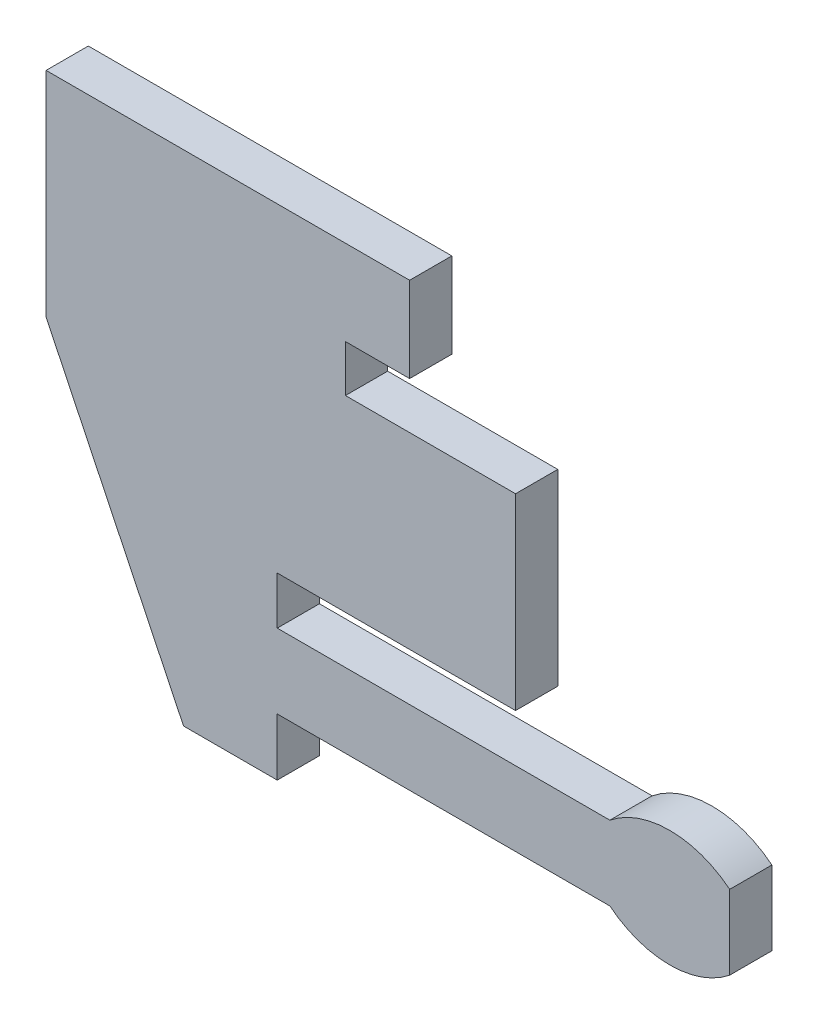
from build123d import *

# Parameters (mm, degrees)
BOSS_EXTRUDE1_DEPTH = 1.524


with BuildPart() as part:
    # Sketch1 → Boss-Extrude1 (new body)
    with BuildSketch(Plane.XY):
        with BuildLine():
            Line((-8.815424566, 0.164170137), (-8.815424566, -1.524))
            Line((-8.815424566, -1.524), (-2.673437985, -1.524))
            Line((-2.673437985, -1.524), (-2.673437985, -8.304467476))
            Line((-2.673437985, -8.304467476), (-11.27796486, -8.304467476))
            Line((-11.27796486, -8.304467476), (-11.27796486, -10.028228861))
            Line((-11.27796486, -10.028228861), (0.731715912, -10.028228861))
            ThreePointArc((0.731715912, -10.028228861), (2.895116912, -9.264788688), (5.058517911, -10.028228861))
            Line((5.058517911, -10.028228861), (5.058517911, -12.711780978))
            ThreePointArc((5.058517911, -12.711780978), (2.895116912, -13.475221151), (0.731715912, -12.711780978))
            Line((0.731715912, -12.711780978), (-11.27796486, -12.711780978))
            Line((-11.27796486, -12.711780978), (-11.27796486, -14.780978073))
            Line((-11.27796486, -14.780978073), (-14.661302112, -14.780978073))
            Line((-14.661302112, -14.780978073), (-19.623991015, -4.475752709))
            Line((-19.623991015, -4.475752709), (-19.623991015, 3.239489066))
            Line((-19.623991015, 3.239489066), (-6.498531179, 3.239489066))
            Line((-6.498531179, 3.239489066), (-6.498531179, 0.164170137))
            Line((-6.498531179, 0.164170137), (-8.815424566, 0.164170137))
        make_face()
    extrude(amount=BOSS_EXTRUDE1_DEPTH)


solid = part.part
